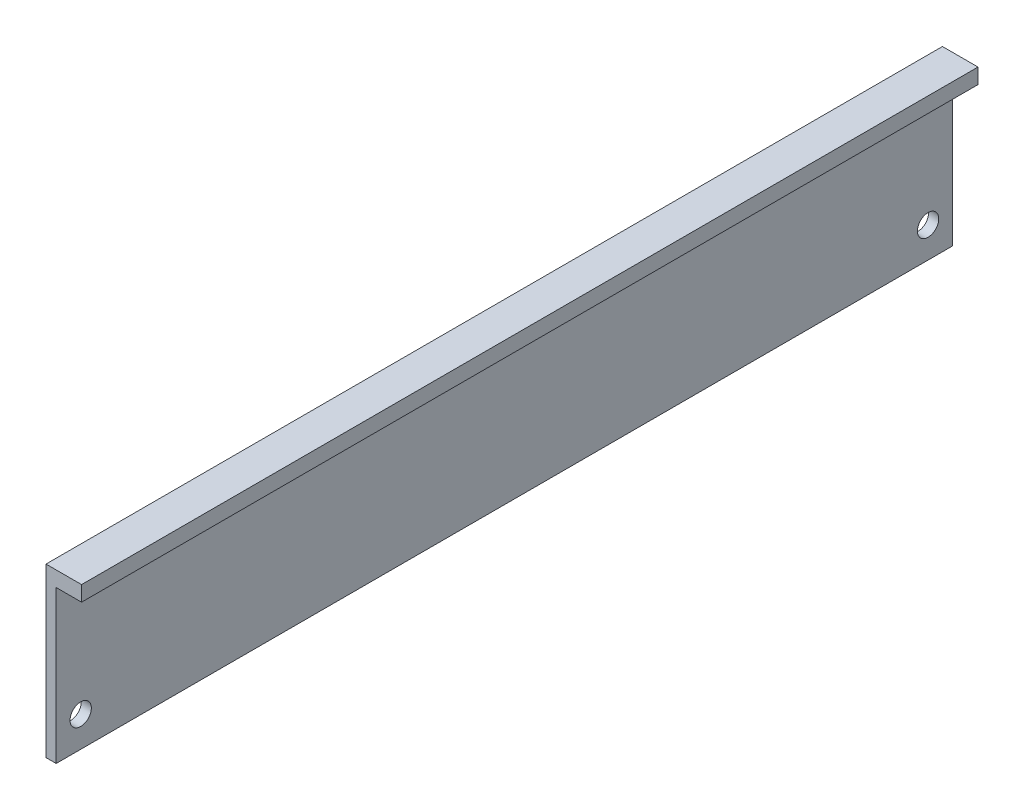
from build123d import *

# Parameters (mm, degrees)
SKETCH_1_W                  = 132
SKETCH_1_H                  = 33
EXTRUDE_1_DEPTH             = 7
SKETCH_2_W                  = 5
SKETCH_2_H                  = 30
CUT_EXTRUDE_1_DEPTH         = 4488.962068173
HOLE_WIZARD_4_2_4_2_1_D     = 4.2
HOLE_WIZARD_4_2_4_2_1_DEPTH = 7
EXTRUDE_2_DEPTH             = 44.45
SKETCH_6_R                  = 2.1
CUT_EXTRUDE_2_DEPTH         = 1701.411606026


with BuildPart() as part:
    # Sketch 1 → Extrude 1 (new body)
    with BuildSketch(Plane(origin=(4153.366453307, 0, 0), x_dir=(0, 0, -1), z_dir=(1, 0, 0))):
        with Locations((66, 1678.76594666)):
            Rectangle(SKETCH_1_W, SKETCH_1_H)
    extrude(amount=-EXTRUDE_1_DEPTH)

    # Sketch 2 → Cut-Extrude 1 (cut, through all)
    with BuildSketch(Plane(origin=(0, 0, -132), x_dir=(-1, 0, 0), z_dir=(0, 0, -1))):
        with Locations((-4150.866453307, 1677.26594666)):
            Rectangle(SKETCH_2_W, SKETCH_2_H)
    extrude(amount=-CUT_EXTRUDE_1_DEPTH, mode=Mode.SUBTRACT)

    # Hole Wizard 4.2 _4.2_ _1
    with Locations(Plane.ZY.offset(-4146.366453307)):
        with Locations((-127.175, 1668.26594666)):
            Hole(HOLE_WIZARD_4_2_4_2_1_D / 2, depth=HOLE_WIZARD_4_2_4_2_1_DEPTH)

    # Sketch 5 → Extrude 2 (add)
    with BuildSketch(Plane.XY):
        Polygon((4148.366453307, 1662.26594666), (4148.366453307, 1692.26594666), (4153.366453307, 1692.26594666), (4153.366453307, 1695.26594666), (4146.366453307, 1695.26594666), (4146.366453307, 1662.26594666), align=None)
    extrude(amount=EXTRUDE_2_DEPTH)

    # Sketch 6 → Cut-Extrude 2 (cut, through all)
    with BuildSketch(Plane.ZY.offset(-4146.366453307)):
        with Locations((39.62, 1668.26594666)):
            Circle(SKETCH_6_R)
        with Locations((-127.175, 1668.26594666)):
            Circle(SKETCH_6_R)
    extrude(amount=-CUT_EXTRUDE_2_DEPTH, mode=Mode.SUBTRACT)


solid = part.part
